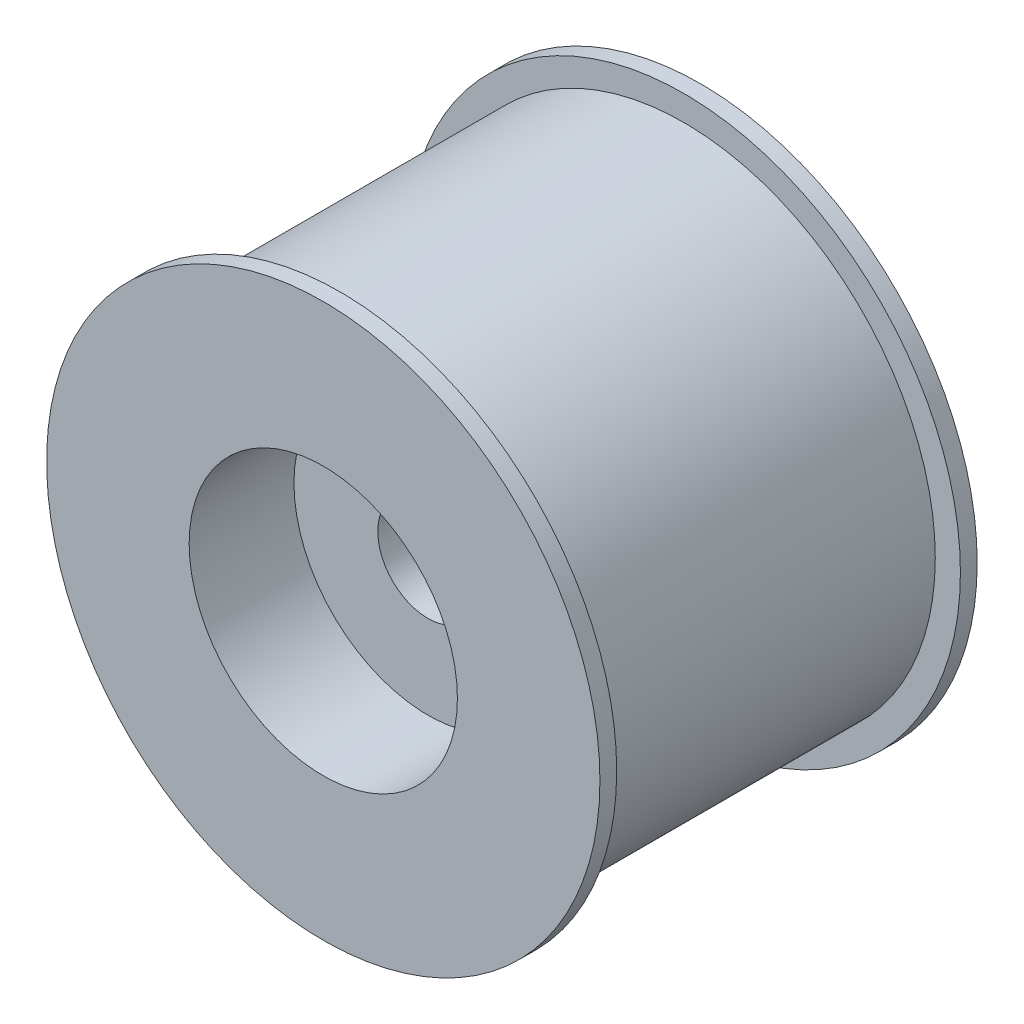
ISO-10303-21;
HEADER;
FILE_DESCRIPTION(('STEP AP214'),'2;1');
FILE_NAME('part.step','',(''),(''),'','','');
FILE_SCHEMA(('AUTOMOTIVE_DESIGN { 1 0 10303 214 1 1 1 1 }'));
ENDSEC;
DATA;
#1=APPLICATION_CONTEXT('core data for automotive mechanical design processes');
#2=APPLICATION_PROTOCOL_DEFINITION('international standard','automotive_design',2000,#1);
#3=PRODUCT_CONTEXT('',#1,'mechanical');
#4=PRODUCT('Part','Part','',(#3));
#5=PRODUCT_RELATED_PRODUCT_CATEGORY('part','',(#4));
#6=PRODUCT_DEFINITION_FORMATION('','',#4);
#7=PRODUCT_DEFINITION_CONTEXT('part definition',#1,'design');
#8=PRODUCT_DEFINITION('design','',#6,#7);
#9=PRODUCT_DEFINITION_SHAPE('','',#8);
#10=(LENGTH_UNIT() NAMED_UNIT(*) SI_UNIT(.MILLI.,.METRE.));
#11=(NAMED_UNIT(*) PLANE_ANGLE_UNIT() SI_UNIT($,.RADIAN.));
#12=(NAMED_UNIT(*) SI_UNIT($,.STERADIAN.) SOLID_ANGLE_UNIT());
#13=UNCERTAINTY_MEASURE_WITH_UNIT(LENGTH_MEASURE(1.E-05),#10,'distance_accuracy_value','');
#14=(GEOMETRIC_REPRESENTATION_CONTEXT(3) GLOBAL_UNCERTAINTY_ASSIGNED_CONTEXT((#13)) GLOBAL_UNIT_ASSIGNED_CONTEXT((#10,
#11,#12)) REPRESENTATION_CONTEXT('',''));
#15=CARTESIAN_POINT('',(0.,0.,0.));
#16=DIRECTION('',(0.,0.,1.));
#17=DIRECTION('',(1.,0.,0.));
#18=AXIS2_PLACEMENT_3D('',#15,#16,#17);
#19=CARTESIAN_POINT('',(0.,0.,7.8646380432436));
#20=DIRECTION('',(0.,0.,1.));
#21=DIRECTION('',(1.,0.,0.));
#22=AXIS2_PLACEMENT_3D('',#19,#20,#21);
#23=CYLINDRICAL_SURFACE('',#22,13.);
#24=CARTESIAN_POINT('',(0.,0.,-22.5));
#25=DIRECTION('',(0.,0.,1.));
#26=DIRECTION('',(1.,0.,0.));
#27=AXIS2_PLACEMENT_3D('',#24,#25,#26);
#28=CIRCLE('',#27,13.);
#29=CARTESIAN_POINT('',(13.,0.,-22.5));
#30=VERTEX_POINT('',#29);
#31=EDGE_CURVE('E52',#30,#30,#28,.T.);
#32=ORIENTED_EDGE('',*,*,#31,.F.);
#33=EDGE_LOOP('',(#32));
#34=FACE_BOUND('',#33,.T.);
#35=CARTESIAN_POINT('',(0.,0.,-10.));
#36=DIRECTION('',(0.,0.,1.));
#37=DIRECTION('',(1.,0.,0.));
#38=AXIS2_PLACEMENT_3D('',#35,#36,#37);
#39=CIRCLE('',#38,13.);
#40=CARTESIAN_POINT('',(13.,0.,-10.));
#41=VERTEX_POINT('',#40);
#42=EDGE_CURVE('E8',#41,#41,#39,.T.);
#43=ORIENTED_EDGE('',*,*,#42,.T.);
#44=EDGE_LOOP('',(#43));
#45=FACE_BOUND('',#44,.T.);
#46=ADVANCED_FACE('F12',(#34,#45),#23,.F.);
#47=CARTESIAN_POINT('',(0.,6.,-10.));
#48=DIRECTION('',(0.,0.,1.));
#49=DIRECTION('',(1.,0.,0.));
#50=AXIS2_PLACEMENT_3D('',#47,#48,#49);
#51=PLANE('',#50);
#52=ORIENTED_EDGE('',*,*,#42,.F.);
#53=EDGE_LOOP('',(#52));
#54=FACE_BOUND('',#53,.T.);
#55=CARTESIAN_POINT('',(0.,0.,-10.));
#56=DIRECTION('',(0.,0.,1.));
#57=DIRECTION('',(1.,0.,0.));
#58=AXIS2_PLACEMENT_3D('',#55,#56,#57);
#59=CIRCLE('',#58,6.);
#60=CARTESIAN_POINT('',(6.,0.,-10.));
#61=VERTEX_POINT('',#60);
#62=EDGE_CURVE('E18',#61,#61,#59,.T.);
#63=ORIENTED_EDGE('',*,*,#62,.T.);
#64=EDGE_LOOP('',(#63));
#65=FACE_BOUND('',#64,.T.);
#66=ADVANCED_FACE('F59',(#54,#65),#51,.F.);
#67=CARTESIAN_POINT('',(0.,0.,7.8646380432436));
#68=DIRECTION('',(0.,0.,1.));
#69=DIRECTION('',(1.,0.,0.));
#70=AXIS2_PLACEMENT_3D('',#67,#68,#69);
#71=CYLINDRICAL_SURFACE('',#70,6.);
#72=ORIENTED_EDGE('',*,*,#62,.F.);
#73=EDGE_LOOP('',(#72));
#74=FACE_BOUND('',#73,.T.);
#75=CARTESIAN_POINT('',(0.,0.,10.));
#76=DIRECTION('',(0.,0.,1.));
#77=DIRECTION('',(1.,0.,0.));
#78=AXIS2_PLACEMENT_3D('',#75,#76,#77);
#79=CIRCLE('',#78,6.);
#80=CARTESIAN_POINT('',(6.,0.,10.));
#81=VERTEX_POINT('',#80);
#82=EDGE_CURVE('E22',#81,#81,#79,.T.);
#83=ORIENTED_EDGE('',*,*,#82,.T.);
#84=EDGE_LOOP('',(#83));
#85=FACE_BOUND('',#84,.T.);
#86=ADVANCED_FACE('F65',(#74,#85),#71,.F.);
#87=CARTESIAN_POINT('',(0.,16.,10.));
#88=DIRECTION('',(0.,0.,-1.));
#89=DIRECTION('',(-1.,0.,0.));
#90=AXIS2_PLACEMENT_3D('',#87,#88,#89);
#91=PLANE('',#90);
#92=ORIENTED_EDGE('',*,*,#82,.F.);
#93=EDGE_LOOP('',(#92));
#94=FACE_BOUND('',#93,.T.);
#95=CARTESIAN_POINT('',(0.,0.,10.));
#96=DIRECTION('',(0.,0.,1.));
#97=DIRECTION('',(1.,0.,0.));
#98=AXIS2_PLACEMENT_3D('',#95,#96,#97);
#99=CIRCLE('',#98,16.);
#100=CARTESIAN_POINT('',(16.,0.,10.));
#101=VERTEX_POINT('',#100);
#102=EDGE_CURVE('E26',#101,#101,#99,.T.);
#103=ORIENTED_EDGE('',*,*,#102,.T.);
#104=EDGE_LOOP('',(#103));
#105=FACE_BOUND('',#104,.T.);
#106=ADVANCED_FACE('F71',(#94,#105),#91,.F.);
#107=CARTESIAN_POINT('',(0.,0.,7.8646380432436));
#108=DIRECTION('',(0.,0.,1.));
#109=DIRECTION('',(1.,0.,0.));
#110=AXIS2_PLACEMENT_3D('',#107,#108,#109);
#111=CYLINDRICAL_SURFACE('',#110,16.);
#112=ORIENTED_EDGE('',*,*,#102,.F.);
#113=EDGE_LOOP('',(#112));
#114=FACE_BOUND('',#113,.T.);
#115=CARTESIAN_POINT('',(0.,0.,22.5));
#116=DIRECTION('',(0.,0.,1.));
#117=DIRECTION('',(1.,0.,0.));
#118=AXIS2_PLACEMENT_3D('',#115,#116,#117);
#119=CIRCLE('',#118,16.);
#120=CARTESIAN_POINT('',(16.,0.,22.5));
#121=VERTEX_POINT('',#120);
#122=EDGE_CURVE('E31',#121,#121,#119,.T.);
#123=ORIENTED_EDGE('',*,*,#122,.T.);
#124=EDGE_LOOP('',(#123));
#125=FACE_BOUND('',#124,.T.);
#126=ADVANCED_FACE('F77',(#114,#125),#111,.F.);
#127=CARTESIAN_POINT('',(0.,33.,22.5));
#128=DIRECTION('',(0.,0.,-1.));
#129=DIRECTION('',(-1.,0.,0.));
#130=AXIS2_PLACEMENT_3D('',#127,#128,#129);
#131=PLANE('',#130);
#132=ORIENTED_EDGE('',*,*,#122,.F.);
#133=EDGE_LOOP('',(#132));
#134=FACE_BOUND('',#133,.T.);
#135=CARTESIAN_POINT('',(0.,0.,22.5));
#136=DIRECTION('',(0.,0.,1.));
#137=DIRECTION('',(1.,0.,0.));
#138=AXIS2_PLACEMENT_3D('',#135,#136,#137);
#139=CIRCLE('',#138,33.);
#140=CARTESIAN_POINT('',(33.,0.,22.5));
#141=VERTEX_POINT('',#140);
#142=EDGE_CURVE('E34',#141,#141,#139,.T.);
#143=ORIENTED_EDGE('',*,*,#142,.T.);
#144=EDGE_LOOP('',(#143));
#145=FACE_BOUND('',#144,.T.);
#146=ADVANCED_FACE('F81',(#134,#145),#131,.F.);
#147=CARTESIAN_POINT('',(0.,0.,7.8646380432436));
#148=DIRECTION('',(0.,0.,1.));
#149=DIRECTION('',(1.,0.,0.));
#150=AXIS2_PLACEMENT_3D('',#147,#148,#149);
#151=CYLINDRICAL_SURFACE('',#150,33.);
#152=ORIENTED_EDGE('',*,*,#142,.F.);
#153=EDGE_LOOP('',(#152));
#154=FACE_BOUND('',#153,.T.);
#155=CARTESIAN_POINT('',(0.,0.,20.5));
#156=DIRECTION('',(0.,0.,1.));
#157=DIRECTION('',(1.,0.,0.));
#158=AXIS2_PLACEMENT_3D('',#155,#156,#157);
#159=CIRCLE('',#158,33.);
#160=CARTESIAN_POINT('',(33.,0.,20.5));
#161=VERTEX_POINT('',#160);
#162=EDGE_CURVE('E37',#161,#161,#159,.T.);
#163=ORIENTED_EDGE('',*,*,#162,.T.);
#164=EDGE_LOOP('',(#163));
#165=FACE_BOUND('',#164,.T.);
#166=ADVANCED_FACE('F85',(#154,#165),#151,.T.);
#167=CARTESIAN_POINT('',(0.,30.,20.5));
#168=DIRECTION('',(0.,0.,1.));
#169=DIRECTION('',(1.,0.,0.));
#170=AXIS2_PLACEMENT_3D('',#167,#168,#169);
#171=PLANE('',#170);
#172=ORIENTED_EDGE('',*,*,#162,.F.);
#173=EDGE_LOOP('',(#172));
#174=FACE_BOUND('',#173,.T.);
#175=CARTESIAN_POINT('',(0.,0.,20.5));
#176=DIRECTION('',(0.,0.,1.));
#177=DIRECTION('',(1.,0.,0.));
#178=AXIS2_PLACEMENT_3D('',#175,#176,#177);
#179=CIRCLE('',#178,30.);
#180=CARTESIAN_POINT('',(30.,0.,20.5));
#181=VERTEX_POINT('',#180);
#182=EDGE_CURVE('E40',#181,#181,#179,.T.);
#183=ORIENTED_EDGE('',*,*,#182,.T.);
#184=EDGE_LOOP('',(#183));
#185=FACE_BOUND('',#184,.T.);
#186=ADVANCED_FACE('F89',(#174,#185),#171,.F.);
#187=CARTESIAN_POINT('',(0.,0.,7.8646380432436));
#188=DIRECTION('',(0.,0.,1.));
#189=DIRECTION('',(1.,0.,0.));
#190=AXIS2_PLACEMENT_3D('',#187,#188,#189);
#191=CYLINDRICAL_SURFACE('',#190,30.);
#192=ORIENTED_EDGE('',*,*,#182,.F.);
#193=EDGE_LOOP('',(#192));
#194=FACE_BOUND('',#193,.T.);
#195=CARTESIAN_POINT('',(0.,0.,-20.5));
#196=DIRECTION('',(0.,0.,1.));
#197=DIRECTION('',(1.,0.,0.));
#198=AXIS2_PLACEMENT_3D('',#195,#196,#197);
#199=CIRCLE('',#198,30.);
#200=CARTESIAN_POINT('',(30.,0.,-20.5));
#201=VERTEX_POINT('',#200);
#202=EDGE_CURVE('E43',#201,#201,#199,.T.);
#203=ORIENTED_EDGE('',*,*,#202,.T.);
#204=EDGE_LOOP('',(#203));
#205=FACE_BOUND('',#204,.T.);
#206=ADVANCED_FACE('F93',(#194,#205),#191,.T.);
#207=CARTESIAN_POINT('',(0.,33.,-20.5));
#208=DIRECTION('',(0.,0.,-1.));
#209=DIRECTION('',(-1.,0.,0.));
#210=AXIS2_PLACEMENT_3D('',#207,#208,#209);
#211=PLANE('',#210);
#212=ORIENTED_EDGE('',*,*,#202,.F.);
#213=EDGE_LOOP('',(#212));
#214=FACE_BOUND('',#213,.T.);
#215=CARTESIAN_POINT('',(0.,0.,-20.5));
#216=DIRECTION('',(0.,0.,1.));
#217=DIRECTION('',(1.,0.,0.));
#218=AXIS2_PLACEMENT_3D('',#215,#216,#217);
#219=CIRCLE('',#218,33.);
#220=CARTESIAN_POINT('',(33.,0.,-20.5));
#221=VERTEX_POINT('',#220);
#222=EDGE_CURVE('E46',#221,#221,#219,.T.);
#223=ORIENTED_EDGE('',*,*,#222,.T.);
#224=EDGE_LOOP('',(#223));
#225=FACE_BOUND('',#224,.T.);
#226=ADVANCED_FACE('F97',(#214,#225),#211,.F.);
#227=CARTESIAN_POINT('',(0.,0.,7.8646380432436));
#228=DIRECTION('',(0.,0.,1.));
#229=DIRECTION('',(1.,0.,0.));
#230=AXIS2_PLACEMENT_3D('',#227,#228,#229);
#231=CYLINDRICAL_SURFACE('',#230,33.);
#232=ORIENTED_EDGE('',*,*,#222,.F.);
#233=EDGE_LOOP('',(#232));
#234=FACE_BOUND('',#233,.T.);
#235=CARTESIAN_POINT('',(0.,0.,-22.5));
#236=DIRECTION('',(0.,0.,1.));
#237=DIRECTION('',(1.,0.,0.));
#238=AXIS2_PLACEMENT_3D('',#235,#236,#237);
#239=CIRCLE('',#238,33.);
#240=CARTESIAN_POINT('',(33.,0.,-22.5));
#241=VERTEX_POINT('',#240);
#242=EDGE_CURVE('E49',#241,#241,#239,.T.);
#243=ORIENTED_EDGE('',*,*,#242,.T.);
#244=EDGE_LOOP('',(#243));
#245=FACE_BOUND('',#244,.T.);
#246=ADVANCED_FACE('F101',(#234,#245),#231,.T.);
#247=CARTESIAN_POINT('',(0.,13.,-22.5));
#248=DIRECTION('',(0.,0.,1.));
#249=DIRECTION('',(1.,0.,0.));
#250=AXIS2_PLACEMENT_3D('',#247,#248,#249);
#251=PLANE('',#250);
#252=ORIENTED_EDGE('',*,*,#242,.F.);
#253=EDGE_LOOP('',(#252));
#254=FACE_BOUND('',#253,.T.);
#255=ORIENTED_EDGE('',*,*,#31,.T.);
#256=EDGE_LOOP('',(#255));
#257=FACE_BOUND('',#256,.T.);
#258=ADVANCED_FACE('F56',(#254,#257),#251,.F.);
#259=CLOSED_SHELL('',(#46,#66,#86,#106,#126,#146,#166,#186,#206,#226,#246,#258));
#260=MANIFOLD_SOLID_BREP('B1',#259);
#261=ADVANCED_BREP_SHAPE_REPRESENTATION('',(#18,#260),#14);
#262=SHAPE_DEFINITION_REPRESENTATION(#9,#261);
ENDSEC;
END-ISO-10303-21;
